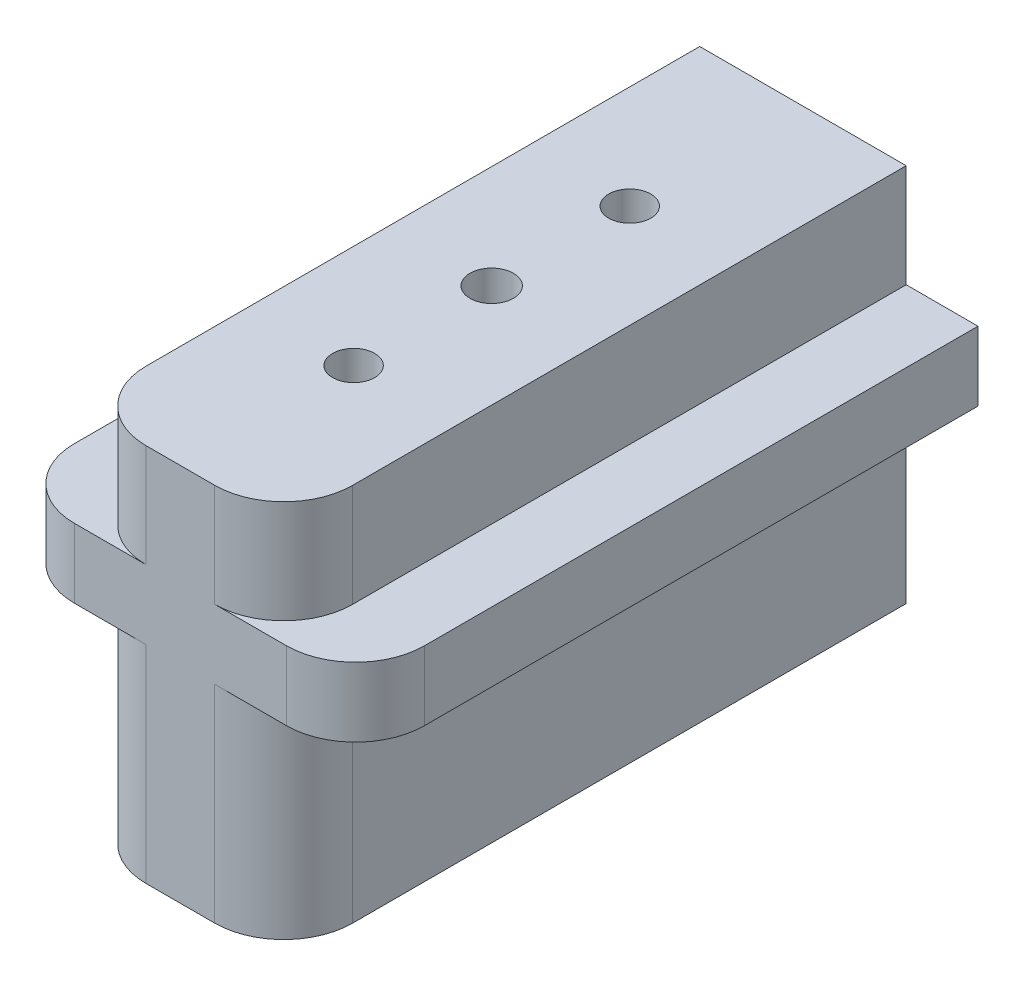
ISO-10303-21;
HEADER;
FILE_DESCRIPTION(('STEP AP214'),'2;1');
FILE_NAME('part.step','',(''),(''),'','','');
FILE_SCHEMA(('AUTOMOTIVE_DESIGN { 1 0 10303 214 1 1 1 1 }'));
ENDSEC;
DATA;
#1=APPLICATION_CONTEXT('core data for automotive mechanical design processes');
#2=APPLICATION_PROTOCOL_DEFINITION('international standard','automotive_design',2000,#1);
#3=PRODUCT_CONTEXT('',#1,'mechanical');
#4=PRODUCT('Part','Part','',(#3));
#5=PRODUCT_RELATED_PRODUCT_CATEGORY('part','',(#4));
#6=PRODUCT_DEFINITION_FORMATION('','',#4);
#7=PRODUCT_DEFINITION_CONTEXT('part definition',#1,'design');
#8=PRODUCT_DEFINITION('design','',#6,#7);
#9=PRODUCT_DEFINITION_SHAPE('','',#8);
#10=(LENGTH_UNIT() NAMED_UNIT(*) SI_UNIT(.MILLI.,.METRE.));
#11=(NAMED_UNIT(*) PLANE_ANGLE_UNIT() SI_UNIT($,.RADIAN.));
#12=(NAMED_UNIT(*) SI_UNIT($,.STERADIAN.) SOLID_ANGLE_UNIT());
#13=UNCERTAINTY_MEASURE_WITH_UNIT(LENGTH_MEASURE(1.E-05),#10,'distance_accuracy_value','');
#14=(GEOMETRIC_REPRESENTATION_CONTEXT(3) GLOBAL_UNCERTAINTY_ASSIGNED_CONTEXT((#13)) GLOBAL_UNIT_ASSIGNED_CONTEXT((#10,
#11,#12)) REPRESENTATION_CONTEXT('',''));
#15=CARTESIAN_POINT('',(0.,0.,0.));
#16=DIRECTION('',(0.,0.,1.));
#17=DIRECTION('',(1.,0.,0.));
#18=AXIS2_PLACEMENT_3D('',#15,#16,#17);
#19=CARTESIAN_POINT('',(-7.1247,13.081,-21.4757));
#20=DIRECTION('',(1.,0.,0.));
#21=DIRECTION('',(0.,0.,-1.));
#22=AXIS2_PLACEMENT_3D('',#19,#20,#21);
#23=PLANE('',#22);
#24=DIRECTION('',(0.,0.,-1.));
#25=VECTOR('',#24,1.);
#26=CARTESIAN_POINT('',(-7.1247,5.969,-21.4757));
#27=LINE('',#26,#25);
#28=CARTESIAN_POINT('',(-7.1247,5.969,16.7132));
#29=VERTEX_POINT('',#28);
#30=CARTESIAN_POINT('',(-7.1247,5.969,-21.4757));
#31=VERTEX_POINT('',#30);
#32=EDGE_CURVE('E232',#29,#31,#27,.T.);
#33=ORIENTED_EDGE('',*,*,#32,.F.);
#34=DIRECTION('',(0.,-1.,0.));
#35=VECTOR('',#34,1.);
#36=CARTESIAN_POINT('',(-7.1247,13.081,16.7132));
#37=LINE('',#36,#35);
#38=CARTESIAN_POINT('',(-7.1247,13.081,16.7132));
#39=VERTEX_POINT('',#38);
#40=EDGE_CURVE('E288',#29,#39,#37,.F.);
#41=ORIENTED_EDGE('',*,*,#40,.T.);
#42=DIRECTION('',(0.,0.,1.));
#43=VECTOR('',#42,1.);
#44=CARTESIAN_POINT('',(-7.1247,13.081,-21.4757));
#45=LINE('',#44,#43);
#46=CARTESIAN_POINT('',(-7.1247,13.081,-21.4757));
#47=VERTEX_POINT('',#46);
#48=EDGE_CURVE('E235',#47,#39,#45,.T.);
#49=ORIENTED_EDGE('',*,*,#48,.F.);
#50=DIRECTION('',(0.,-1.,0.));
#51=VECTOR('',#50,1.);
#52=CARTESIAN_POINT('',(-7.1247,13.081,-21.4757));
#53=LINE('',#52,#51);
#54=EDGE_CURVE('E256',#47,#31,#53,.T.);
#55=ORIENTED_EDGE('',*,*,#54,.T.);
#56=EDGE_LOOP('',(#33,#41,#49,#55));
#57=FACE_BOUND('',#56,.T.);
#58=ADVANCED_FACE('F39',(#57),#23,.F.);
#59=CARTESIAN_POINT('',(7.1247,13.081,-21.4757));
#60=DIRECTION('',(-1.,0.,0.));
#61=DIRECTION('',(0.,0.,1.));
#62=AXIS2_PLACEMENT_3D('',#59,#60,#61);
#63=PLANE('',#62);
#64=DIRECTION('',(0.,0.,-1.));
#65=VECTOR('',#64,1.);
#66=CARTESIAN_POINT('',(7.1247,13.081,-21.4757));
#67=LINE('',#66,#65);
#68=CARTESIAN_POINT('',(7.1247,13.081,16.7132));
#69=VERTEX_POINT('',#68);
#70=CARTESIAN_POINT('',(7.1247,13.081,-21.4757));
#71=VERTEX_POINT('',#70);
#72=EDGE_CURVE('E242',#69,#71,#67,.T.);
#73=ORIENTED_EDGE('',*,*,#72,.F.);
#74=DIRECTION('',(0.,-1.,0.));
#75=VECTOR('',#74,1.);
#76=CARTESIAN_POINT('',(7.1247,13.081,16.7132));
#77=LINE('',#76,#75);
#78=CARTESIAN_POINT('',(7.1247,5.969,16.7132));
#79=VERTEX_POINT('',#78);
#80=EDGE_CURVE('E281',#69,#79,#77,.T.);
#81=ORIENTED_EDGE('',*,*,#80,.T.);
#82=DIRECTION('',(0.,0.,1.));
#83=VECTOR('',#82,1.);
#84=CARTESIAN_POINT('',(7.1247,5.969,-21.4757));
#85=LINE('',#84,#83);
#86=CARTESIAN_POINT('',(7.1247,5.969,-21.4757));
#87=VERTEX_POINT('',#86);
#88=EDGE_CURVE('E229',#87,#79,#85,.T.);
#89=ORIENTED_EDGE('',*,*,#88,.F.);
#90=DIRECTION('',(0.,-1.,0.));
#91=VECTOR('',#90,1.);
#92=CARTESIAN_POINT('',(7.1247,13.081,-21.4757));
#93=LINE('',#92,#91);
#94=EDGE_CURVE('E260',#71,#87,#93,.T.);
#95=ORIENTED_EDGE('',*,*,#94,.F.);
#96=EDGE_LOOP('',(#73,#81,#89,#95));
#97=FACE_BOUND('',#96,.T.);
#98=ADVANCED_FACE('F389',(#97),#63,.F.);
#99=DIRECTION('',(0.,0.,1.));
#100=VECTOR('',#99,1.);
#101=CARTESIAN_POINT('',(-7.1247,-13.081,-21.4757));
#102=LINE('',#101,#100);
#103=CARTESIAN_POINT('',(-7.1247,-13.081,-21.4757));
#104=VERTEX_POINT('',#103);
#105=CARTESIAN_POINT('',(-7.1247,-13.081,16.7132));
#106=VERTEX_POINT('',#105);
#107=EDGE_CURVE('E234',#104,#106,#102,.T.);
#108=ORIENTED_EDGE('',*,*,#107,.T.);
#109=DIRECTION('',(0.,-1.,0.));
#110=VECTOR('',#109,1.);
#111=CARTESIAN_POINT('',(-7.1247,13.081,16.7132));
#112=LINE('',#111,#110);
#113=CARTESIAN_POINT('',(-7.1247,1.1938,16.7132));
#114=VERTEX_POINT('',#113);
#115=EDGE_CURVE('E290',#106,#114,#112,.F.);
#116=ORIENTED_EDGE('',*,*,#115,.T.);
#117=DIRECTION('',(0.,0.,-1.));
#118=VECTOR('',#117,1.);
#119=CARTESIAN_POINT('',(-7.1247,1.1938,-21.4757));
#120=LINE('',#119,#118);
#121=CARTESIAN_POINT('',(-7.1247,1.1938,-21.4757));
#122=VERTEX_POINT('',#121);
#123=EDGE_CURVE('E227',#114,#122,#120,.T.);
#124=ORIENTED_EDGE('',*,*,#123,.T.);
#125=EDGE_CURVE('E246',#122,#104,#53,.T.);
#126=ORIENTED_EDGE('',*,*,#125,.T.);
#127=EDGE_LOOP('',(#108,#116,#124,#126));
#128=FACE_BOUND('',#127,.T.);
#129=ADVANCED_FACE('F354',(#128),#23,.F.);
#130=CARTESIAN_POINT('',(-7.1247,13.081,21.4757));
#131=DIRECTION('',(0.,0.,-1.));
#132=DIRECTION('',(-1.,0.,0.));
#133=AXIS2_PLACEMENT_3D('',#130,#131,#132);
#134=PLANE('',#133);
#135=DIRECTION('',(1.,0.,0.));
#136=VECTOR('',#135,1.);
#137=CARTESIAN_POINT('',(12.0777,1.1938,21.4757));
#138=LINE('',#137,#136);
#139=CARTESIAN_POINT('',(2.3622,1.1938,21.4757));
#140=VERTEX_POINT('',#139);
#141=CARTESIAN_POINT('',(7.3152,1.1938,21.4757));
#142=VERTEX_POINT('',#141);
#143=EDGE_CURVE('E217',#140,#142,#138,.T.);
#144=ORIENTED_EDGE('',*,*,#143,.T.);
#145=DIRECTION('',(0.,-1.,0.));
#146=VECTOR('',#145,1.);
#147=CARTESIAN_POINT('',(7.3152,13.081,21.4757));
#148=LINE('',#147,#146);
#149=CARTESIAN_POINT('',(7.3152,5.969,21.4757));
#150=VERTEX_POINT('',#149);
#151=EDGE_CURVE('E310',#142,#150,#148,.F.);
#152=ORIENTED_EDGE('',*,*,#151,.T.);
#153=DIRECTION('',(1.,0.,0.));
#154=VECTOR('',#153,1.);
#155=CARTESIAN_POINT('',(12.0777,5.969,21.4757));
#156=LINE('',#155,#154);
#157=CARTESIAN_POINT('',(2.3622,5.969,21.4757));
#158=VERTEX_POINT('',#157);
#159=EDGE_CURVE('E206',#158,#150,#156,.T.);
#160=ORIENTED_EDGE('',*,*,#159,.F.);
#161=DIRECTION('',(0.,-1.,0.));
#162=VECTOR('',#161,1.);
#163=CARTESIAN_POINT('',(2.3622,13.081,21.4757));
#164=LINE('',#163,#162);
#165=CARTESIAN_POINT('',(2.3622,13.081,21.4757));
#166=VERTEX_POINT('',#165);
#167=EDGE_CURVE('E276',#158,#166,#164,.F.);
#168=ORIENTED_EDGE('',*,*,#167,.T.);
#169=DIRECTION('',(1.,0.,0.));
#170=VECTOR('',#169,1.);
#171=CARTESIAN_POINT('',(-7.1247,13.081,21.4757));
#172=LINE('',#171,#170);
#173=CARTESIAN_POINT('',(-2.3622,13.081,21.4757));
#174=VERTEX_POINT('',#173);
#175=EDGE_CURVE('E238',#174,#166,#172,.T.);
#176=ORIENTED_EDGE('',*,*,#175,.F.);
#177=DIRECTION('',(0.,-1.,0.));
#178=VECTOR('',#177,1.);
#179=CARTESIAN_POINT('',(-2.3622,13.081,21.4757));
#180=LINE('',#179,#178);
#181=CARTESIAN_POINT('',(-2.3622,5.969,21.4757));
#182=VERTEX_POINT('',#181);
#183=EDGE_CURVE('E273',#174,#182,#180,.T.);
#184=ORIENTED_EDGE('',*,*,#183,.T.);
#185=CARTESIAN_POINT('',(-7.3152,5.969,21.4757));
#186=VERTEX_POINT('',#185);
#187=EDGE_CURVE('E207',#186,#182,#156,.T.);
#188=ORIENTED_EDGE('',*,*,#187,.F.);
#189=DIRECTION('',(0.,-1.,0.));
#190=VECTOR('',#189,1.);
#191=CARTESIAN_POINT('',(-7.3152,13.081,21.4757));
#192=LINE('',#191,#190);
#193=CARTESIAN_POINT('',(-7.3152,1.1938,21.4757));
#194=VERTEX_POINT('',#193);
#195=EDGE_CURVE('E307',#186,#194,#192,.T.);
#196=ORIENTED_EDGE('',*,*,#195,.T.);
#197=CARTESIAN_POINT('',(-2.3622,1.1938,21.4757));
#198=VERTEX_POINT('',#197);
#199=EDGE_CURVE('E201',#194,#198,#138,.T.);
#200=ORIENTED_EDGE('',*,*,#199,.T.);
#201=DIRECTION('',(0.,-1.,0.));
#202=VECTOR('',#201,1.);
#203=CARTESIAN_POINT('',(-2.3622,13.081,21.4757));
#204=LINE('',#203,#202);
#205=CARTESIAN_POINT('',(-2.3622,-13.081,21.4757));
#206=VERTEX_POINT('',#205);
#207=EDGE_CURVE('E270',#198,#206,#204,.T.);
#208=ORIENTED_EDGE('',*,*,#207,.T.);
#209=DIRECTION('',(1.,0.,0.));
#210=VECTOR('',#209,1.);
#211=CARTESIAN_POINT('',(-7.1247,-13.081,21.4757));
#212=LINE('',#211,#210);
#213=CARTESIAN_POINT('',(2.3622,-13.081,21.4757));
#214=VERTEX_POINT('',#213);
#215=EDGE_CURVE('E249',#206,#214,#212,.T.);
#216=ORIENTED_EDGE('',*,*,#215,.T.);
#217=DIRECTION('',(0.,-1.,0.));
#218=VECTOR('',#217,1.);
#219=CARTESIAN_POINT('',(2.3622,13.081,21.4757));
#220=LINE('',#219,#218);
#221=EDGE_CURVE('E278',#214,#140,#220,.F.);
#222=ORIENTED_EDGE('',*,*,#221,.T.);
#223=EDGE_LOOP('',(#144,#152,#160,#168,#176,#184,#188,#196,#200,#208,#216,#222));
#224=FACE_BOUND('',#223,.T.);
#225=ADVANCED_FACE('F333',(#224),#134,.F.);
#226=DIRECTION('',(0.,0.,1.));
#227=VECTOR('',#226,1.);
#228=CARTESIAN_POINT('',(7.1247,1.1938,-21.4757));
#229=LINE('',#228,#227);
#230=CARTESIAN_POINT('',(7.1247,1.1938,-21.4757));
#231=VERTEX_POINT('',#230);
#232=CARTESIAN_POINT('',(7.1247,1.1938,16.7132));
#233=VERTEX_POINT('',#232);
#234=EDGE_CURVE('E224',#231,#233,#229,.T.);
#235=ORIENTED_EDGE('',*,*,#234,.T.);
#236=DIRECTION('',(0.,-1.,0.));
#237=VECTOR('',#236,1.);
#238=CARTESIAN_POINT('',(7.1247,13.081,16.7132));
#239=LINE('',#238,#237);
#240=CARTESIAN_POINT('',(7.1247,-13.081,16.7132));
#241=VERTEX_POINT('',#240);
#242=EDGE_CURVE('E263',#233,#241,#239,.T.);
#243=ORIENTED_EDGE('',*,*,#242,.T.);
#244=DIRECTION('',(0.,0.,-1.));
#245=VECTOR('',#244,1.);
#246=CARTESIAN_POINT('',(7.1247,-13.081,-21.4757));
#247=LINE('',#246,#245);
#248=CARTESIAN_POINT('',(7.1247,-13.081,-21.4757));
#249=VERTEX_POINT('',#248);
#250=EDGE_CURVE('E252',#241,#249,#247,.T.);
#251=ORIENTED_EDGE('',*,*,#250,.T.);
#252=EDGE_CURVE('E259',#231,#249,#93,.T.);
#253=ORIENTED_EDGE('',*,*,#252,.F.);
#254=EDGE_LOOP('',(#235,#243,#251,#253));
#255=FACE_BOUND('',#254,.T.);
#256=ADVANCED_FACE('F342',(#255),#63,.F.);
#257=CARTESIAN_POINT('',(-7.1247,13.081,-21.4757));
#258=DIRECTION('',(0.,0.,1.));
#259=DIRECTION('',(1.,0.,0.));
#260=AXIS2_PLACEMENT_3D('',#257,#258,#259);
#261=PLANE('',#260);
#262=ORIENTED_EDGE('',*,*,#125,.F.);
#263=DIRECTION('',(-1.,0.,0.));
#264=VECTOR('',#263,1.);
#265=CARTESIAN_POINT('',(12.0777,1.1938,-21.4757));
#266=LINE('',#265,#264);
#267=CARTESIAN_POINT('',(-12.0777,1.1938,-21.4757));
#268=VERTEX_POINT('',#267);
#269=EDGE_CURVE('E211',#122,#268,#266,.T.);
#270=ORIENTED_EDGE('',*,*,#269,.T.);
#271=DIRECTION('',(0.,-1.,0.));
#272=VECTOR('',#271,1.);
#273=CARTESIAN_POINT('',(-12.0777,5.969,-21.4757));
#274=LINE('',#273,#272);
#275=CARTESIAN_POINT('',(-12.0777,5.969,-21.4757));
#276=VERTEX_POINT('',#275);
#277=EDGE_CURVE('E209',#276,#268,#274,.T.);
#278=ORIENTED_EDGE('',*,*,#277,.F.);
#279=DIRECTION('',(-1.,0.,0.));
#280=VECTOR('',#279,1.);
#281=CARTESIAN_POINT('',(12.0777,5.969,-21.4757));
#282=LINE('',#281,#280);
#283=EDGE_CURVE('E200',#31,#276,#282,.T.);
#284=ORIENTED_EDGE('',*,*,#283,.F.);
#285=ORIENTED_EDGE('',*,*,#54,.F.);
#286=DIRECTION('',(-1.,0.,0.));
#287=VECTOR('',#286,1.);
#288=CARTESIAN_POINT('',(-7.1247,13.081,-21.4757));
#289=LINE('',#288,#287);
#290=EDGE_CURVE('E244',#71,#47,#289,.T.);
#291=ORIENTED_EDGE('',*,*,#290,.F.);
#292=ORIENTED_EDGE('',*,*,#94,.T.);
#293=CARTESIAN_POINT('',(12.0777,5.969,-21.4757));
#294=VERTEX_POINT('',#293);
#295=EDGE_CURVE('E202',#294,#87,#282,.T.);
#296=ORIENTED_EDGE('',*,*,#295,.F.);
#297=DIRECTION('',(0.,-1.,0.));
#298=VECTOR('',#297,1.);
#299=CARTESIAN_POINT('',(12.0777,5.969,-21.4757));
#300=LINE('',#299,#298);
#301=CARTESIAN_POINT('',(12.0777,1.1938,-21.4757));
#302=VERTEX_POINT('',#301);
#303=EDGE_CURVE('E221',#294,#302,#300,.T.);
#304=ORIENTED_EDGE('',*,*,#303,.T.);
#305=EDGE_CURVE('E212',#302,#231,#266,.T.);
#306=ORIENTED_EDGE('',*,*,#305,.T.);
#307=ORIENTED_EDGE('',*,*,#252,.T.);
#308=DIRECTION('',(-1.,0.,0.));
#309=VECTOR('',#308,1.);
#310=CARTESIAN_POINT('',(-7.1247,-13.081,-21.4757));
#311=LINE('',#310,#309);
#312=EDGE_CURVE('E239',#249,#104,#311,.T.);
#313=ORIENTED_EDGE('',*,*,#312,.T.);
#314=EDGE_LOOP('',(#262,#270,#278,#284,#285,#291,#292,#296,#304,#306,#307,#313));
#315=FACE_BOUND('',#314,.T.);
#316=ADVANCED_FACE('F348',(#315),#261,.F.);
#317=CARTESIAN_POINT('',(-7.1247,13.081,21.4757));
#318=DIRECTION('',(0.,1.,0.));
#319=DIRECTION('',(0.,0.,1.));
#320=AXIS2_PLACEMENT_3D('',#317,#318,#319);
#321=PLANE('',#320);
#322=CARTESIAN_POINT('',(0.,13.081,0.));
#323=DIRECTION('',(0.,1.,0.));
#324=DIRECTION('',(0.,0.,1.));
#325=AXIS2_PLACEMENT_3D('',#322,#323,#324);
#326=CIRCLE('',#325,1.5);
#327=CARTESIAN_POINT('',(0.,13.081,1.5));
#328=VERTEX_POINT('',#327);
#329=EDGE_CURVE('E180',#328,#328,#326,.T.);
#330=ORIENTED_EDGE('',*,*,#329,.F.);
#331=EDGE_LOOP('',(#330));
#332=FACE_BOUND('',#331,.T.);
#333=CARTESIAN_POINT('',(0.,13.081,9.525));
#334=DIRECTION('',(0.,1.,0.));
#335=DIRECTION('',(0.,0.,1.));
#336=AXIS2_PLACEMENT_3D('',#333,#334,#335);
#337=CIRCLE('',#336,1.45);
#338=CARTESIAN_POINT('',(0.,13.081,10.975));
#339=VERTEX_POINT('',#338);
#340=EDGE_CURVE('E188',#339,#339,#337,.T.);
#341=ORIENTED_EDGE('',*,*,#340,.F.);
#342=EDGE_LOOP('',(#341));
#343=FACE_BOUND('',#342,.T.);
#344=CARTESIAN_POINT('',(0.,13.081,-9.525));
#345=DIRECTION('',(0.,1.,0.));
#346=DIRECTION('',(0.,0.,1.));
#347=AXIS2_PLACEMENT_3D('',#344,#345,#346);
#348=CIRCLE('',#347,1.45);
#349=CARTESIAN_POINT('',(0.,13.081,-8.075));
#350=VERTEX_POINT('',#349);
#351=EDGE_CURVE('E194',#350,#350,#348,.T.);
#352=ORIENTED_EDGE('',*,*,#351,.F.);
#353=EDGE_LOOP('',(#352));
#354=FACE_BOUND('',#353,.T.);
#355=ORIENTED_EDGE('',*,*,#175,.T.);
#356=CARTESIAN_POINT('',(2.3622,13.081,16.7132));
#357=DIRECTION('',(0.,1.,0.));
#358=DIRECTION('',(0.,0.,1.));
#359=AXIS2_PLACEMENT_3D('',#356,#357,#358);
#360=CIRCLE('',#359,4.7625);
#361=EDGE_CURVE('E286',#166,#69,#360,.T.);
#362=ORIENTED_EDGE('',*,*,#361,.T.);
#363=ORIENTED_EDGE('',*,*,#72,.T.);
#364=ORIENTED_EDGE('',*,*,#290,.T.);
#365=ORIENTED_EDGE('',*,*,#48,.T.);
#366=CARTESIAN_POINT('',(-2.3622,13.081,16.7132));
#367=DIRECTION('',(0.,1.,0.));
#368=DIRECTION('',(0.,0.,1.));
#369=AXIS2_PLACEMENT_3D('',#366,#367,#368);
#370=CIRCLE('',#369,4.7625);
#371=EDGE_CURVE('E284',#39,#174,#370,.T.);
#372=ORIENTED_EDGE('',*,*,#371,.T.);
#373=EDGE_LOOP('',(#355,#362,#363,#364,#365,#372));
#374=FACE_BOUND('',#373,.T.);
#375=ADVANCED_FACE('F382',(#332,#343,#354,#374),#321,.T.);
#376=CARTESIAN_POINT('',(-7.1247,-13.081,21.4757));
#377=DIRECTION('',(0.,1.,0.));
#378=DIRECTION('',(0.,0.,1.));
#379=AXIS2_PLACEMENT_3D('',#376,#377,#378);
#380=PLANE('',#379);
#381=ORIENTED_EDGE('',*,*,#250,.F.);
#382=CARTESIAN_POINT('',(2.3622,-13.081,16.7132));
#383=DIRECTION('',(0.,1.,0.));
#384=DIRECTION('',(0.,0.,1.));
#385=AXIS2_PLACEMENT_3D('',#382,#383,#384);
#386=CIRCLE('',#385,4.7625);
#387=EDGE_CURVE('E268',#241,#214,#386,.F.);
#388=ORIENTED_EDGE('',*,*,#387,.T.);
#389=ORIENTED_EDGE('',*,*,#215,.F.);
#390=CARTESIAN_POINT('',(-2.3622,-13.081,16.7132));
#391=DIRECTION('',(0.,1.,0.));
#392=DIRECTION('',(0.,0.,1.));
#393=AXIS2_PLACEMENT_3D('',#390,#391,#392);
#394=CIRCLE('',#393,4.7625);
#395=EDGE_CURVE('E266',#206,#106,#394,.F.);
#396=ORIENTED_EDGE('',*,*,#395,.T.);
#397=ORIENTED_EDGE('',*,*,#107,.F.);
#398=ORIENTED_EDGE('',*,*,#312,.F.);
#399=EDGE_LOOP('',(#381,#388,#389,#396,#397,#398));
#400=FACE_BOUND('',#399,.T.);
#401=ADVANCED_FACE('F351',(#400),#380,.F.);
#402=CARTESIAN_POINT('',(12.0777,5.969,-21.4757));
#403=DIRECTION('',(-1.,0.,0.));
#404=DIRECTION('',(0.,0.,1.));
#405=AXIS2_PLACEMENT_3D('',#402,#403,#404);
#406=PLANE('',#405);
#407=DIRECTION('',(0.,0.,-1.));
#408=VECTOR('',#407,1.);
#409=CARTESIAN_POINT('',(12.0777,5.969,-21.4757));
#410=LINE('',#409,#408);
#411=CARTESIAN_POINT('',(12.0777,5.969,16.7132));
#412=VERTEX_POINT('',#411);
#413=EDGE_CURVE('E198',#412,#294,#410,.T.);
#414=ORIENTED_EDGE('',*,*,#413,.F.);
#415=DIRECTION('',(0.,-1.,0.));
#416=VECTOR('',#415,1.);
#417=CARTESIAN_POINT('',(12.0777,5.969,16.7132));
#418=LINE('',#417,#416);
#419=CARTESIAN_POINT('',(12.0777,1.1938,16.7132));
#420=VERTEX_POINT('',#419);
#421=EDGE_CURVE('E302',#412,#420,#418,.T.);
#422=ORIENTED_EDGE('',*,*,#421,.T.);
#423=DIRECTION('',(0.,0.,-1.));
#424=VECTOR('',#423,1.);
#425=CARTESIAN_POINT('',(12.0777,1.1938,-21.4757));
#426=LINE('',#425,#424);
#427=EDGE_CURVE('E197',#420,#302,#426,.T.);
#428=ORIENTED_EDGE('',*,*,#427,.T.);
#429=ORIENTED_EDGE('',*,*,#303,.F.);
#430=EDGE_LOOP('',(#414,#422,#428,#429));
#431=FACE_BOUND('',#430,.T.);
#432=ADVANCED_FACE('F325',(#431),#406,.F.);
#433=CARTESIAN_POINT('',(12.0777,1.1938,21.4757));
#434=DIRECTION('',(0.,-1.,0.));
#435=DIRECTION('',(0.,0.,-1.));
#436=AXIS2_PLACEMENT_3D('',#433,#434,#435);
#437=PLANE('',#436);
#438=ORIENTED_EDGE('',*,*,#427,.F.);
#439=CARTESIAN_POINT('',(7.3152,1.1938,16.7132));
#440=DIRECTION('',(0.,-1.,0.));
#441=DIRECTION('',(0.,0.,-1.));
#442=AXIS2_PLACEMENT_3D('',#439,#440,#441);
#443=CIRCLE('',#442,4.7625);
#444=EDGE_CURVE('E305',#420,#142,#443,.T.);
#445=ORIENTED_EDGE('',*,*,#444,.T.);
#446=ORIENTED_EDGE('',*,*,#143,.F.);
#447=CARTESIAN_POINT('',(2.3622,1.1938,16.7132));
#448=DIRECTION('',(0.,-1.,0.));
#449=DIRECTION('',(0.,0.,-1.));
#450=AXIS2_PLACEMENT_3D('',#447,#448,#449);
#451=CIRCLE('',#450,4.7625);
#452=EDGE_CURVE('E292',#140,#233,#451,.F.);
#453=ORIENTED_EDGE('',*,*,#452,.T.);
#454=ORIENTED_EDGE('',*,*,#234,.F.);
#455=ORIENTED_EDGE('',*,*,#305,.F.);
#456=EDGE_LOOP('',(#438,#445,#446,#453,#454,#455));
#457=FACE_BOUND('',#456,.T.);
#458=ADVANCED_FACE('F330',(#457),#437,.T.);
#459=CARTESIAN_POINT('',(12.0777,5.969,21.4757));
#460=DIRECTION('',(0.,-1.,0.));
#461=DIRECTION('',(0.,0.,-1.));
#462=AXIS2_PLACEMENT_3D('',#459,#460,#461);
#463=PLANE('',#462);
#464=ORIENTED_EDGE('',*,*,#159,.T.);
#465=CARTESIAN_POINT('',(7.3152,5.969,16.7132));
#466=DIRECTION('',(0.,-1.,0.));
#467=DIRECTION('',(0.,0.,-1.));
#468=AXIS2_PLACEMENT_3D('',#465,#466,#467);
#469=CIRCLE('',#468,4.7625);
#470=EDGE_CURVE('E312',#150,#412,#469,.F.);
#471=ORIENTED_EDGE('',*,*,#470,.T.);
#472=ORIENTED_EDGE('',*,*,#413,.T.);
#473=ORIENTED_EDGE('',*,*,#295,.T.);
#474=ORIENTED_EDGE('',*,*,#88,.T.);
#475=CARTESIAN_POINT('',(2.3622,5.969,16.7132));
#476=DIRECTION('',(0.,-1.,0.));
#477=DIRECTION('',(0.,0.,-1.));
#478=AXIS2_PLACEMENT_3D('',#475,#476,#477);
#479=CIRCLE('',#478,4.7625);
#480=EDGE_CURVE('E294',#79,#158,#479,.T.);
#481=ORIENTED_EDGE('',*,*,#480,.T.);
#482=EDGE_LOOP('',(#464,#471,#472,#473,#474,#481));
#483=FACE_BOUND('',#482,.T.);
#484=ADVANCED_FACE('F318',(#483),#463,.F.);
#485=DIRECTION('',(0.,0.,1.));
#486=VECTOR('',#485,1.);
#487=CARTESIAN_POINT('',(-12.0777,5.969,-21.4757));
#488=LINE('',#487,#486);
#489=CARTESIAN_POINT('',(-12.0777,5.969,16.7132));
#490=VERTEX_POINT('',#489);
#491=EDGE_CURVE('E204',#276,#490,#488,.T.);
#492=ORIENTED_EDGE('',*,*,#491,.T.);
#493=CARTESIAN_POINT('',(-7.3152,5.969,16.7132));
#494=DIRECTION('',(0.,-1.,0.));
#495=DIRECTION('',(0.,0.,-1.));
#496=AXIS2_PLACEMENT_3D('',#493,#494,#495);
#497=CIRCLE('',#496,4.7625);
#498=EDGE_CURVE('E11',#490,#186,#497,.F.);
#499=ORIENTED_EDGE('',*,*,#498,.T.);
#500=ORIENTED_EDGE('',*,*,#187,.T.);
#501=CARTESIAN_POINT('',(-2.3622,5.969,16.7132));
#502=DIRECTION('',(0.,-1.,0.));
#503=DIRECTION('',(0.,0.,-1.));
#504=AXIS2_PLACEMENT_3D('',#501,#502,#503);
#505=CIRCLE('',#504,4.7625);
#506=EDGE_CURVE('E297',#182,#29,#505,.T.);
#507=ORIENTED_EDGE('',*,*,#506,.T.);
#508=ORIENTED_EDGE('',*,*,#32,.T.);
#509=ORIENTED_EDGE('',*,*,#283,.T.);
#510=EDGE_LOOP('',(#492,#499,#500,#507,#508,#509));
#511=FACE_BOUND('',#510,.T.);
#512=ADVANCED_FACE('F367',(#511),#463,.F.);
#513=ORIENTED_EDGE('',*,*,#199,.F.);
#514=CARTESIAN_POINT('',(-7.3152,1.1938,16.7132));
#515=DIRECTION('',(0.,-1.,0.));
#516=DIRECTION('',(0.,0.,-1.));
#517=AXIS2_PLACEMENT_3D('',#514,#515,#516);
#518=CIRCLE('',#517,4.7625);
#519=CARTESIAN_POINT('',(-12.0777,1.1938,16.7132));
#520=VERTEX_POINT('',#519);
#521=EDGE_CURVE('E61',#194,#520,#518,.T.);
#522=ORIENTED_EDGE('',*,*,#521,.T.);
#523=DIRECTION('',(0.,0.,1.));
#524=VECTOR('',#523,1.);
#525=CARTESIAN_POINT('',(-12.0777,1.1938,-21.4757));
#526=LINE('',#525,#524);
#527=EDGE_CURVE('E215',#268,#520,#526,.T.);
#528=ORIENTED_EDGE('',*,*,#527,.F.);
#529=ORIENTED_EDGE('',*,*,#269,.F.);
#530=ORIENTED_EDGE('',*,*,#123,.F.);
#531=CARTESIAN_POINT('',(-2.3622,1.1938,16.7132));
#532=DIRECTION('',(0.,-1.,0.));
#533=DIRECTION('',(0.,0.,-1.));
#534=AXIS2_PLACEMENT_3D('',#531,#532,#533);
#535=CIRCLE('',#534,4.7625);
#536=EDGE_CURVE('E299',#114,#198,#535,.F.);
#537=ORIENTED_EDGE('',*,*,#536,.T.);
#538=EDGE_LOOP('',(#513,#522,#528,#529,#530,#537));
#539=FACE_BOUND('',#538,.T.);
#540=ADVANCED_FACE('F360',(#539),#437,.T.);
#541=CARTESIAN_POINT('',(-12.0777,5.969,-21.4757));
#542=DIRECTION('',(1.,0.,0.));
#543=DIRECTION('',(0.,0.,-1.));
#544=AXIS2_PLACEMENT_3D('',#541,#542,#543);
#545=PLANE('',#544);
#546=ORIENTED_EDGE('',*,*,#527,.T.);
#547=DIRECTION('',(0.,-1.,0.));
#548=VECTOR('',#547,1.);
#549=CARTESIAN_POINT('',(-12.0777,5.969,16.7132));
#550=LINE('',#549,#548);
#551=EDGE_CURVE('E47',#520,#490,#550,.F.);
#552=ORIENTED_EDGE('',*,*,#551,.T.);
#553=ORIENTED_EDGE('',*,*,#491,.F.);
#554=ORIENTED_EDGE('',*,*,#277,.T.);
#555=EDGE_LOOP('',(#546,#552,#553,#554));
#556=FACE_BOUND('',#555,.T.);
#557=ADVANCED_FACE('F364',(#556),#545,.F.);
#558=CARTESIAN_POINT('',(2.3622,13.081,16.7132));
#559=DIRECTION('',(0.,-1.,0.));
#560=DIRECTION('',(0.,0.,-1.));
#561=AXIS2_PLACEMENT_3D('',#558,#559,#560);
#562=CYLINDRICAL_SURFACE('',#561,4.7625);
#563=ORIENTED_EDGE('',*,*,#452,.F.);
#564=ORIENTED_EDGE('',*,*,#221,.F.);
#565=ORIENTED_EDGE('',*,*,#387,.F.);
#566=ORIENTED_EDGE('',*,*,#242,.F.);
#567=EDGE_LOOP('',(#563,#564,#565,#566));
#568=FACE_BOUND('',#567,.T.);
#569=ADVANCED_FACE('F339',(#568),#562,.T.);
#570=CARTESIAN_POINT('',(2.3622,13.081,16.7132));
#571=DIRECTION('',(0.,-1.,0.));
#572=DIRECTION('',(0.,0.,-1.));
#573=AXIS2_PLACEMENT_3D('',#570,#571,#572);
#574=CYLINDRICAL_SURFACE('',#573,4.7625);
#575=ORIENTED_EDGE('',*,*,#361,.F.);
#576=ORIENTED_EDGE('',*,*,#167,.F.);
#577=ORIENTED_EDGE('',*,*,#480,.F.);
#578=ORIENTED_EDGE('',*,*,#80,.F.);
#579=EDGE_LOOP('',(#575,#576,#577,#578));
#580=FACE_BOUND('',#579,.T.);
#581=ADVANCED_FACE('F394',(#580),#574,.T.);
#582=CARTESIAN_POINT('',(-2.3622,13.081,16.7132));
#583=DIRECTION('',(0.,-1.,0.));
#584=DIRECTION('',(0.,0.,-1.));
#585=AXIS2_PLACEMENT_3D('',#582,#583,#584);
#586=CYLINDRICAL_SURFACE('',#585,4.7625);
#587=ORIENTED_EDGE('',*,*,#371,.F.);
#588=ORIENTED_EDGE('',*,*,#40,.F.);
#589=ORIENTED_EDGE('',*,*,#506,.F.);
#590=ORIENTED_EDGE('',*,*,#183,.F.);
#591=EDGE_LOOP('',(#587,#588,#589,#590));
#592=FACE_BOUND('',#591,.T.);
#593=ADVANCED_FACE('F378',(#592),#586,.T.);
#594=CARTESIAN_POINT('',(-2.3622,13.081,16.7132));
#595=DIRECTION('',(0.,-1.,0.));
#596=DIRECTION('',(0.,0.,-1.));
#597=AXIS2_PLACEMENT_3D('',#594,#595,#596);
#598=CYLINDRICAL_SURFACE('',#597,4.7625);
#599=ORIENTED_EDGE('',*,*,#536,.F.);
#600=ORIENTED_EDGE('',*,*,#115,.F.);
#601=ORIENTED_EDGE('',*,*,#395,.F.);
#602=ORIENTED_EDGE('',*,*,#207,.F.);
#603=EDGE_LOOP('',(#599,#600,#601,#602));
#604=FACE_BOUND('',#603,.T.);
#605=ADVANCED_FACE('F358',(#604),#598,.T.);
#606=CARTESIAN_POINT('',(7.3152,5.969,16.7132));
#607=DIRECTION('',(0.,-1.,0.));
#608=DIRECTION('',(0.,0.,-1.));
#609=AXIS2_PLACEMENT_3D('',#606,#607,#608);
#610=CYLINDRICAL_SURFACE('',#609,4.7625);
#611=ORIENTED_EDGE('',*,*,#470,.F.);
#612=ORIENTED_EDGE('',*,*,#151,.F.);
#613=ORIENTED_EDGE('',*,*,#444,.F.);
#614=ORIENTED_EDGE('',*,*,#421,.F.);
#615=EDGE_LOOP('',(#611,#612,#613,#614));
#616=FACE_BOUND('',#615,.T.);
#617=ADVANCED_FACE('F327',(#616),#610,.T.);
#618=CARTESIAN_POINT('',(-7.3152,13.081,16.7132));
#619=DIRECTION('',(0.,-1.,0.));
#620=DIRECTION('',(0.,0.,-1.));
#621=AXIS2_PLACEMENT_3D('',#618,#619,#620);
#622=CYLINDRICAL_SURFACE('',#621,4.7625);
#623=ORIENTED_EDGE('',*,*,#498,.F.);
#624=ORIENTED_EDGE('',*,*,#551,.F.);
#625=ORIENTED_EDGE('',*,*,#521,.F.);
#626=ORIENTED_EDGE('',*,*,#195,.F.);
#627=EDGE_LOOP('',(#623,#624,#625,#626));
#628=FACE_BOUND('',#627,.T.);
#629=ADVANCED_FACE('F41',(#628),#622,.T.);
#630=CARTESIAN_POINT('',(0.,13.081,-9.525));
#631=DIRECTION('',(0.,1.,0.));
#632=DIRECTION('',(0.,0.,1.));
#633=AXIS2_PLACEMENT_3D('',#630,#631,#632);
#634=CYLINDRICAL_SURFACE('',#633,1.45);
#635=CARTESIAN_POINT('',(0.,3.431,-9.525));
#636=DIRECTION('',(0.,1.,0.));
#637=DIRECTION('',(0.,0.,1.));
#638=AXIS2_PLACEMENT_3D('',#635,#636,#637);
#639=CIRCLE('',#638,1.45);
#640=CARTESIAN_POINT('',(0.,3.431,-8.075));
#641=VERTEX_POINT('',#640);
#642=EDGE_CURVE('E191',#641,#641,#639,.T.);
#643=ORIENTED_EDGE('',*,*,#642,.F.);
#644=EDGE_LOOP('',(#643));
#645=FACE_BOUND('',#644,.T.);
#646=ORIENTED_EDGE('',*,*,#351,.T.);
#647=EDGE_LOOP('',(#646));
#648=FACE_BOUND('',#647,.T.);
#649=ADVANCED_FACE('F433',(#645,#648),#634,.F.);
#650=CARTESIAN_POINT('',(0.,3.431,-9.525));
#651=DIRECTION('',(0.,1.,0.));
#652=DIRECTION('',(0.,0.,1.));
#653=AXIS2_PLACEMENT_3D('',#650,#651,#652);
#654=CONICAL_SURFACE('',#653,1.45,1.02974425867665);
#655=CARTESIAN_POINT('',(0.,2.55975210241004,-9.525));
#656=VERTEX_POINT('',#655);
#657=VERTEX_LOOP('',#656);
#658=FACE_BOUND('',#657,.T.);
#659=ORIENTED_EDGE('',*,*,#642,.T.);
#660=EDGE_LOOP('',(#659));
#661=FACE_BOUND('',#660,.T.);
#662=ADVANCED_FACE('F436',(#658,#661),#654,.F.);
#663=CARTESIAN_POINT('',(0.,13.081,9.525));
#664=DIRECTION('',(0.,1.,0.));
#665=DIRECTION('',(0.,0.,1.));
#666=AXIS2_PLACEMENT_3D('',#663,#664,#665);
#667=CYLINDRICAL_SURFACE('',#666,1.45);
#668=CARTESIAN_POINT('',(0.,3.431,9.525));
#669=DIRECTION('',(0.,1.,0.));
#670=DIRECTION('',(0.,0.,1.));
#671=AXIS2_PLACEMENT_3D('',#668,#669,#670);
#672=CIRCLE('',#671,1.45);
#673=CARTESIAN_POINT('',(0.,3.431,10.975));
#674=VERTEX_POINT('',#673);
#675=EDGE_CURVE('E183',#674,#674,#672,.T.);
#676=ORIENTED_EDGE('',*,*,#675,.F.);
#677=EDGE_LOOP('',(#676));
#678=FACE_BOUND('',#677,.T.);
#679=ORIENTED_EDGE('',*,*,#340,.T.);
#680=EDGE_LOOP('',(#679));
#681=FACE_BOUND('',#680,.T.);
#682=ADVANCED_FACE('F440',(#678,#681),#667,.F.);
#683=CARTESIAN_POINT('',(0.,3.431,9.525));
#684=DIRECTION('',(0.,1.,0.));
#685=DIRECTION('',(0.,0.,1.));
#686=AXIS2_PLACEMENT_3D('',#683,#684,#685);
#687=CONICAL_SURFACE('',#686,1.45,1.02974425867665);
#688=CARTESIAN_POINT('',(0.,2.55975210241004,9.525));
#689=VERTEX_POINT('',#688);
#690=VERTEX_LOOP('',#689);
#691=FACE_BOUND('',#690,.T.);
#692=ORIENTED_EDGE('',*,*,#675,.T.);
#693=EDGE_LOOP('',(#692));
#694=FACE_BOUND('',#693,.T.);
#695=ADVANCED_FACE('F444',(#691,#694),#687,.F.);
#696=CARTESIAN_POINT('',(0.,13.081,0.));
#697=DIRECTION('',(0.,1.,0.));
#698=DIRECTION('',(0.,0.,1.));
#699=AXIS2_PLACEMENT_3D('',#696,#697,#698);
#700=CYLINDRICAL_SURFACE('',#699,1.5);
#701=CARTESIAN_POINT('',(0.,7.081,0.));
#702=DIRECTION('',(0.,1.,0.));
#703=DIRECTION('',(0.,0.,1.));
#704=AXIS2_PLACEMENT_3D('',#701,#702,#703);
#705=CIRCLE('',#704,1.5);
#706=CARTESIAN_POINT('',(0.,7.081,1.5));
#707=VERTEX_POINT('',#706);
#708=EDGE_CURVE('E178',#707,#707,#705,.T.);
#709=ORIENTED_EDGE('',*,*,#708,.F.);
#710=EDGE_LOOP('',(#709));
#711=FACE_BOUND('',#710,.T.);
#712=ORIENTED_EDGE('',*,*,#329,.T.);
#713=EDGE_LOOP('',(#712));
#714=FACE_BOUND('',#713,.T.);
#715=ADVANCED_FACE('F174',(#711,#714),#700,.F.);
#716=CARTESIAN_POINT('',(0.,7.081,0.));
#717=DIRECTION('',(0.,1.,0.));
#718=DIRECTION('',(0.,0.,1.));
#719=AXIS2_PLACEMENT_3D('',#716,#717,#718);
#720=CONICAL_SURFACE('',#719,1.5,1.02974425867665);
#721=CARTESIAN_POINT('',(0.,6.17970907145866,0.));
#722=VERTEX_POINT('',#721);
#723=VERTEX_LOOP('',#722);
#724=FACE_BOUND('',#723,.T.);
#725=ORIENTED_EDGE('',*,*,#708,.T.);
#726=EDGE_LOOP('',(#725));
#727=FACE_BOUND('',#726,.T.);
#728=ADVANCED_FACE('F171',(#724,#727),#720,.F.);
#729=CLOSED_SHELL('',(#58,#98,#129,#225,#256,#316,#375,#401,#432,#458,#484,#512,#540,#557,#569,
#581,#593,#605,#617,#629,#649,#662,#682,#695,#715,#728));
#730=MANIFOLD_SOLID_BREP('B2',#729);
#731=ADVANCED_BREP_SHAPE_REPRESENTATION('',(#18,#730),#14);
#732=SHAPE_DEFINITION_REPRESENTATION(#9,#731);
ENDSEC;
END-ISO-10303-21;
